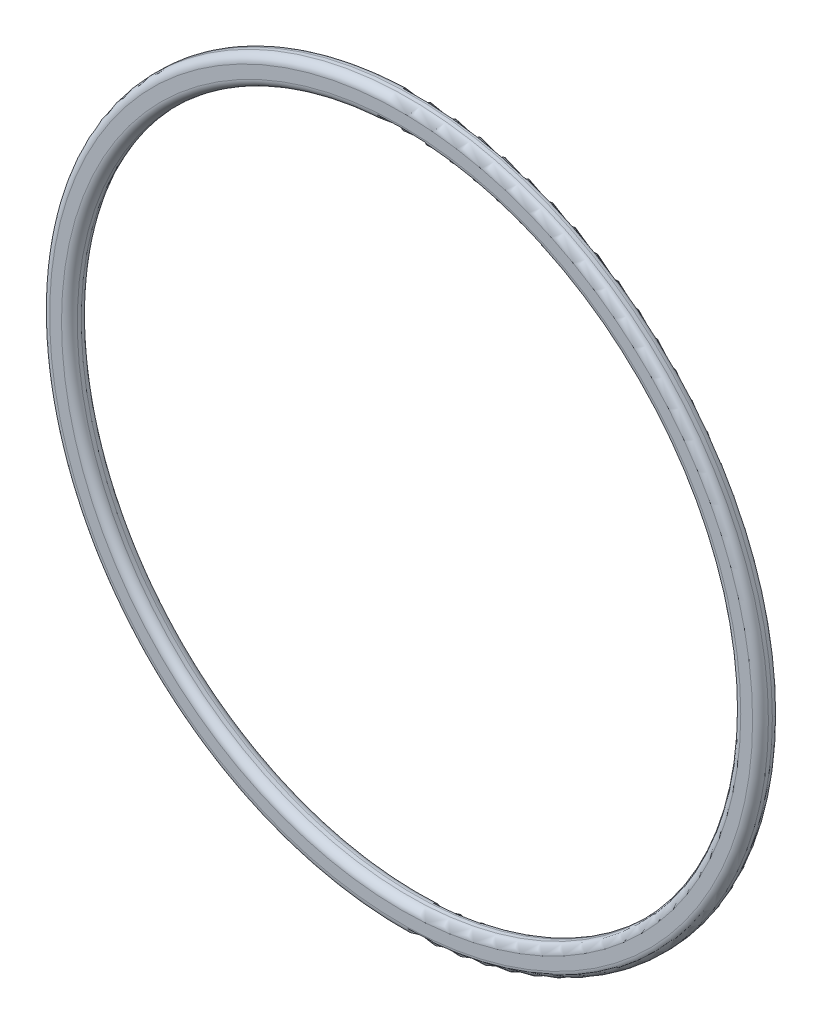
from build123d import *


with BuildPart() as part:
    # Esquisse1 → R_volution1 (revolve)
    with BuildSketch(Plane(origin=(0, 0, 0), x_dir=(0, 0, -1), z_dir=(1, 0, 0)), mode=Mode.PRIVATE) as r_volution1_sk:
        with BuildLine():
            Line((1.459361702, 45.5), (1.959361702, 45.5))
            ThreePointArc((1.959361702, 45.5), (2.666468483, 45.207106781), (2.959361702, 44.5))
            Line((2.959361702, 44.5), (2.959361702, 43))
            ThreePointArc((2.959361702, 43), (2.666468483, 42.292893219), (1.959361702, 42))
            Line((1.959361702, 42), (1.459361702, 42))
            ThreePointArc((1.459361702, 42), (0.752254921, 42.292893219), (0.459361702, 43))
            Line((0.459361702, 43), (0.459361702, 44.5))
            ThreePointArc((0.459361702, 44.5), (0.752254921, 45.207106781), (1.459361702, 45.5))
        make_face()
    revolve(r_volution1_sk.sketch.rotate(Axis((0, 0, 20.824397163), (0, 0, -1)), 90), axis=Axis((0, 0, 20.824397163), (0, 0, -1)))


solid = part.part
